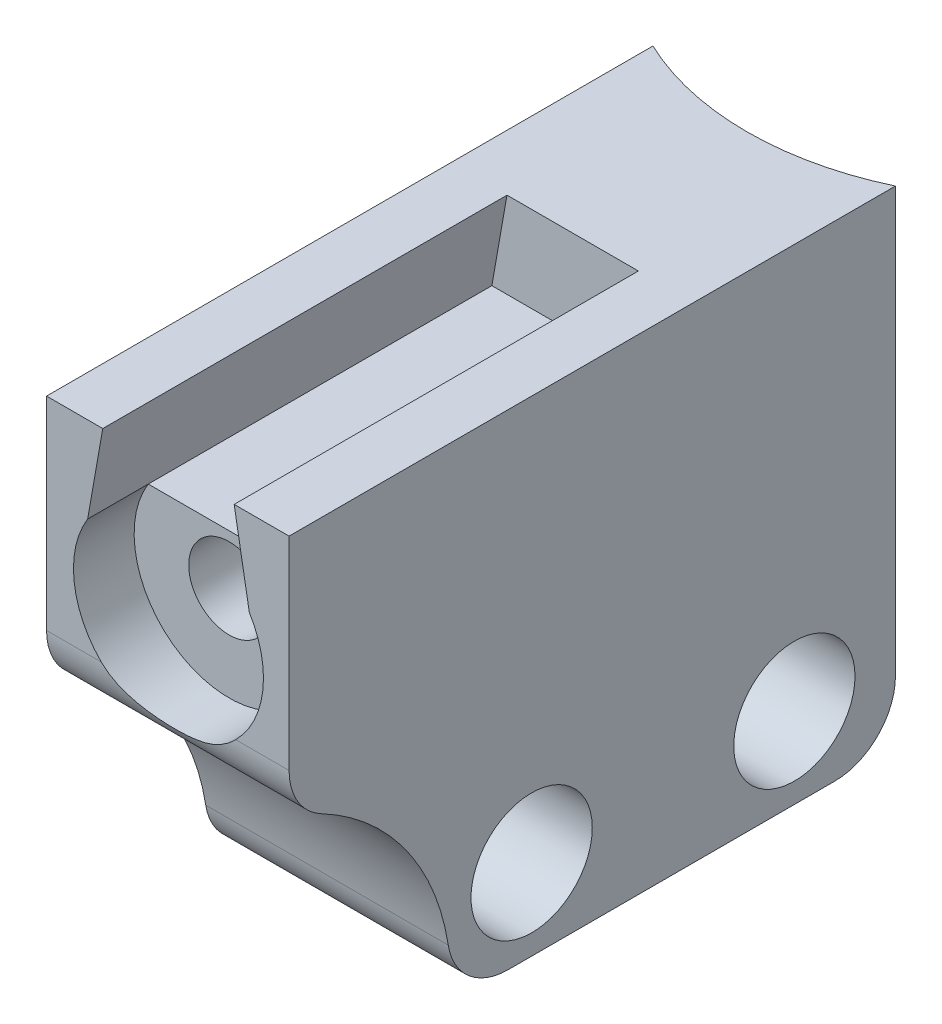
from build123d import *

# Parameters (mm, degrees)
SKETCH_1_R               = 3
EXTRUDE_1_DEPTH          = 6
FILLET_1_R               = 3
CUT_EXTRUDE_1_DEPTH      = 33.86335345
CUT_EXTRUDE_1_DEPTH_BACK = 33.86335345
SKETCH_2_R               = 2
CUT_EXTRUDE_2_DEPTH      = 20
CUT_EXTRUDE_3_DEPTH      = 3
CUT_EXTRUDE_4_DEPTH      = 29.930952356
CUT_EXTRUDE_4_DEPTH_BACK = 29.930952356


with BuildPart() as part:
    # Sketch 1 → Extrude 1 (new, symmetric)
    with BuildSketch(Plane(origin=(0, 0, 0), x_dir=(0, 0, -1), z_dir=(1, 0, 0))):
        with BuildLine():
            Line((-15, 12), (15, 12))
            Line((15, 12), (15, -12))
            Line((15, -12), (-7, -12))
            ThreePointArc((-7, -12), (-8.996142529, -4.664095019), (-15, 0))
            Line((-15, 0), (-15, 12))
        make_face()
        with Locations((10, -8)):
            Circle(SKETCH_1_R, mode=Mode.SUBTRACT)
        with Locations((-3, -8)):
            Circle(SKETCH_1_R, mode=Mode.SUBTRACT)
    extrude(amount=EXTRUDE_1_DEPTH, both=True)

    # Fillet 1
    fillet_1_edges = [part.edges().sort_by_distance(p)[0] for p in [
        (0, -12, -15),
        (0, -12, 7),
        (0, 0, 15),
    ]]
    fillet(fillet_1_edges, radius=FILLET_1_R)

    # Sketch 2 → Cut-Extrude 1 (cut, two sides: drawn at the far end of the back side and taken through both)
    with BuildSketch(Plane.XY.offset(15).offset(-CUT_EXTRUDE_1_DEPTH_BACK)):
        with Locations((0.031963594, 5.278746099)):
            Circle(SKETCH_2_R)
    extrude(amount=CUT_EXTRUDE_1_DEPTH + CUT_EXTRUDE_1_DEPTH_BACK, mode=Mode.SUBTRACT)

    # Sketch 2_3 → Cut-Extrude 2 (cut)
    with BuildSketch(Plane.XY.offset(15)):
        Polygon((-3.218036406, 12), (-3.968036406, 7.746538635), (0, 7.746538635), (0, 12), align=None)
        Polygon((0, 7.746538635), (4.031963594, 7.746538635), (3.281963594, 12), (0, 12), align=None)
    extrude(amount=-CUT_EXTRUDE_2_DEPTH, mode=Mode.SUBTRACT)

    # Sketch 2_4 → Cut-Extrude 3 (cut)
    with BuildSketch(Plane.XY.offset(15)):
        with BuildLine():
            Line((-3.292237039, 1.956143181), (0, 1.956143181))
            Line((0, 1.956143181), (0, 3.279001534))
            ThreePointArc((0, 3.279001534), (-1.968036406, 5.278746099), (0, 7.278490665))
            Line((0, 7.278490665), (0, 7.746538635))
            Line((0, 7.746538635), (-3.968036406, 7.746538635))
            ThreePointArc((-3.968036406, 7.746538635), (-4.636349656, 4.733905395), (-3.292237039, 1.956143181))
        make_face()
        with BuildLine():
            Line((0, 3.279001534), (0, 1.956143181))
            Line((0, 1.956143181), (3.356164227, 1.956143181))
            ThreePointArc((3.356164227, 1.956143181), (4.700276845, 4.733905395), (4.031963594, 7.746538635))
            Line((4.031963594, 7.746538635), (0, 7.746538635))
            Line((0, 7.746538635), (0, 7.278490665))
            ThreePointArc((0, 7.278490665), (1.434830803, 6.704215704), (2.031963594, 5.278746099))
            ThreePointArc((2.031963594, 5.278746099), (1.434830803, 3.853276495), (0, 3.279001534))
        make_face()
        with BuildLine():
            Line((-3.292237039, 1.956143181), (0, 1.956143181))
            Line((0, 1.956143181), (0, 3.279001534))
            ThreePointArc((0, 3.279001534), (-1.968036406, 5.278746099), (0, 7.278490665))
            Line((0, 7.278490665), (0, 7.746538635))
            Line((0, 7.746538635), (-3.968036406, 7.746538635))
            ThreePointArc((-3.968036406, 7.746538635), (-4.636349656, 4.733905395), (-3.292237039, 1.956143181))
        make_face()
        with BuildLine():
            Line((0, 3.279001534), (0, 1.956143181))
            Line((0, 1.956143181), (3.356164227, 1.956143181))
            ThreePointArc((3.356164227, 1.956143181), (4.700276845, 4.733905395), (4.031963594, 7.746538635))
            Line((4.031963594, 7.746538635), (0, 7.746538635))
            Line((0, 7.746538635), (0, 7.278490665))
            ThreePointArc((0, 7.278490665), (1.434830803, 6.704215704), (2.031963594, 5.278746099))
            ThreePointArc((2.031963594, 5.278746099), (1.434830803, 3.853276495), (0, 3.279001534))
        make_face()
        with BuildLine():
            ThreePointArc((-3.292237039, 1.956143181), (-1.781924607, 0.942871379), (0, 0.578854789))
            Line((0, 0.578854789), (0, 1.956143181))
            Line((0, 1.956143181), (-3.292237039, 1.956143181))
        make_face()
        with BuildLine():
            Line((0, 1.956143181), (0, 0.578854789))
            ThreePointArc((0, 0.578854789), (1.816322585, 0.930635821), (3.356164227, 1.956143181))
            Line((3.356164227, 1.956143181), (0, 1.956143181))
        make_face()
        with BuildLine():
            ThreePointArc((-3.292237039, 1.956143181), (-1.781924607, 0.942871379), (0, 0.578854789))
            Line((0, 0.578854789), (0, 1.956143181))
            Line((0, 1.956143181), (-3.292237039, 1.956143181))
        make_face()
        with BuildLine():
            Line((0, 1.956143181), (0, 0.578854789))
            ThreePointArc((0, 0.578854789), (1.816322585, 0.930635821), (3.356164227, 1.956143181))
            Line((3.356164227, 1.956143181), (0, 1.956143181))
        make_face()
    extrude(amount=-CUT_EXTRUDE_3_DEPTH, mode=Mode.SUBTRACT)

    # Sketch 4 → Cut-Extrude 4 (cut, two sides: drawn at the far end of the back side and taken through both)
    with BuildSketch(Plane(origin=(0, 12, 0), x_dir=(1, 0, 0), z_dir=(0, 1, 0)).offset(-CUT_EXTRUDE_4_DEPTH_BACK)):
        with BuildLine():
            Line((-73.421546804, 46.980847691), (-6, 15))
            ThreePointArc((-6, 15), (0, 13.649110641), (6, 15))
            Line((6, 15), (73.421546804, 46.980847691))
            Line((73.421546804, 46.980847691), (73.421546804, 196.224803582))
            Line((73.421546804, 196.224803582), (-73.421546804, 196.224803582))
            Line((-73.421546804, 196.224803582), (-73.421546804, 46.980847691))
        make_face()
    extrude(amount=CUT_EXTRUDE_4_DEPTH + CUT_EXTRUDE_4_DEPTH_BACK, mode=Mode.SUBTRACT)


solid = part.part
